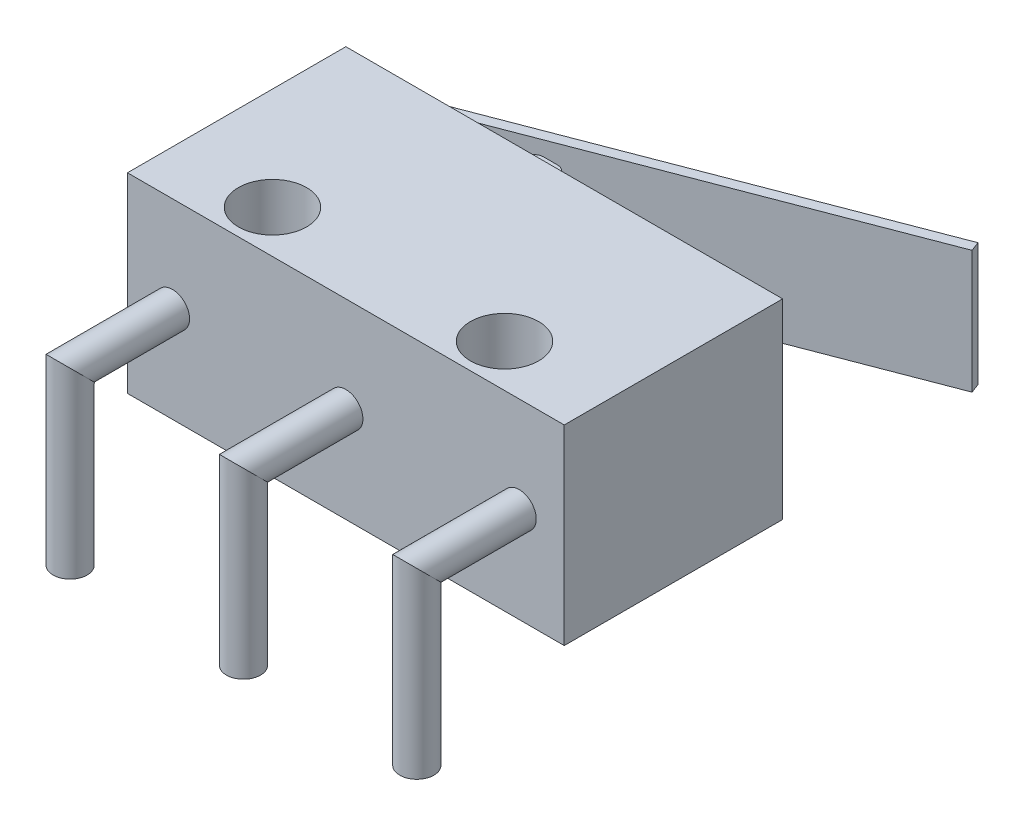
from build123d import *

# Parameters (mm, degrees)
ESQUISSE1_W      = 12.8
ESQUISSE1_H      = 6.4
ESQUISSE1_R      = 1
EXTRUSION1_DEPTH = 5.6
ESQUISSE2_W      = 1
ESQUISSE2_H      = 2.8
EXTRUSION2_DEPTH = 1.5
CONG_1_R         = 0.3
ESQUISSE3_W      = 0.3
ESQUISSE3_H      = 3.6
ESQUISSE6_R      = 0.5


with BuildPart() as part:
    # Esquisse1 → Extrusion1 (new body)
    with BuildSketch(Plane(origin=(0, 0, 0), x_dir=(1, 0, 0), z_dir=(0, 1, 0))):
        with Locations((6.4, 3.2)):
            Rectangle(ESQUISSE1_W, ESQUISSE1_H)
        with Locations(Location((3, 1.25, 0), (0, 0, 270))):
            Circle(ESQUISSE1_R, mode=Mode.SUBTRACT)
        with Locations(Location((9.8, 1.25, 0), (0, 0, 90))):
            Circle(ESQUISSE1_R, mode=Mode.SUBTRACT)
    extrude(amount=EXTRUSION1_DEPTH)

    # Esquisse2 → Extrusion2 (add)
    with BuildSketch(Plane(origin=(0, 0, -6.4), x_dir=(-1, 0, 0), z_dir=(0, 0, -1))):
        with Locations((-4.5, 2.8)):
            Rectangle(ESQUISSE2_W, ESQUISSE2_H)
    extrude(amount=EXTRUSION2_DEPTH)

    # Cong_1
    cong_1_edges = [part.edges().sort_by_distance(p)[0] for p in [
        (4, 2.8, -7.9),
        (5, 2.8, -7.9),
    ]]
    fillet(cong_1_edges, radius=CONG_1_R)

    # Balayage1: sweep along a path in Esquisse4
    with BuildLine(Plane(origin=(0, 2.8, 0), x_dir=(-1, 0, 0), z_dir=(0, 1, 0))) as balayage1_path:
        Line((-1.15, -6.4), (-1.15, -6.728014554))
        ThreePointArc((-1.15, -6.728014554), (-1.194032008, -6.869708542), (-1.31061749, -6.961489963))
        Line((-1.31061749, -6.961489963), (-13.290721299, -11.547890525))
    # Esquisse3 → Balayage1 (sweep)
    with BuildSketch(Plane(origin=(0, 0, -6.4), x_dir=(-1, 0, 0), z_dir=(0, 0, -1))):
        with Locations((-1.15, 2.8)):
            Rectangle(ESQUISSE3_W, ESQUISSE3_H)
    sweep(path=balayage1_path.line)

    # Balayage2: sweep along a path in Esquisse7
    with BuildLine(Plane(origin=(6.4, 0, 0), x_dir=(0, 0, -1), z_dir=(1, 0, 0))) as balayage2_path:
        Line((0, 2.8), (-3, 2.8))
        Line((-3, 2.8), (-3, -2.2))
    # Esquisse6 → Balayage2 (sweep)
    with BuildSketch(Plane.XY):
        with Locations((6.4, 2.8)):
            Circle(ESQUISSE6_R)
        with Locations((1.32, 2.8)):
            Circle(ESQUISSE6_R)
        with Locations((11.48, 2.8)):
            Circle(ESQUISSE6_R)
    sweep(path=balayage2_path.line, transition=Transition.RIGHT)


solid = part.part
